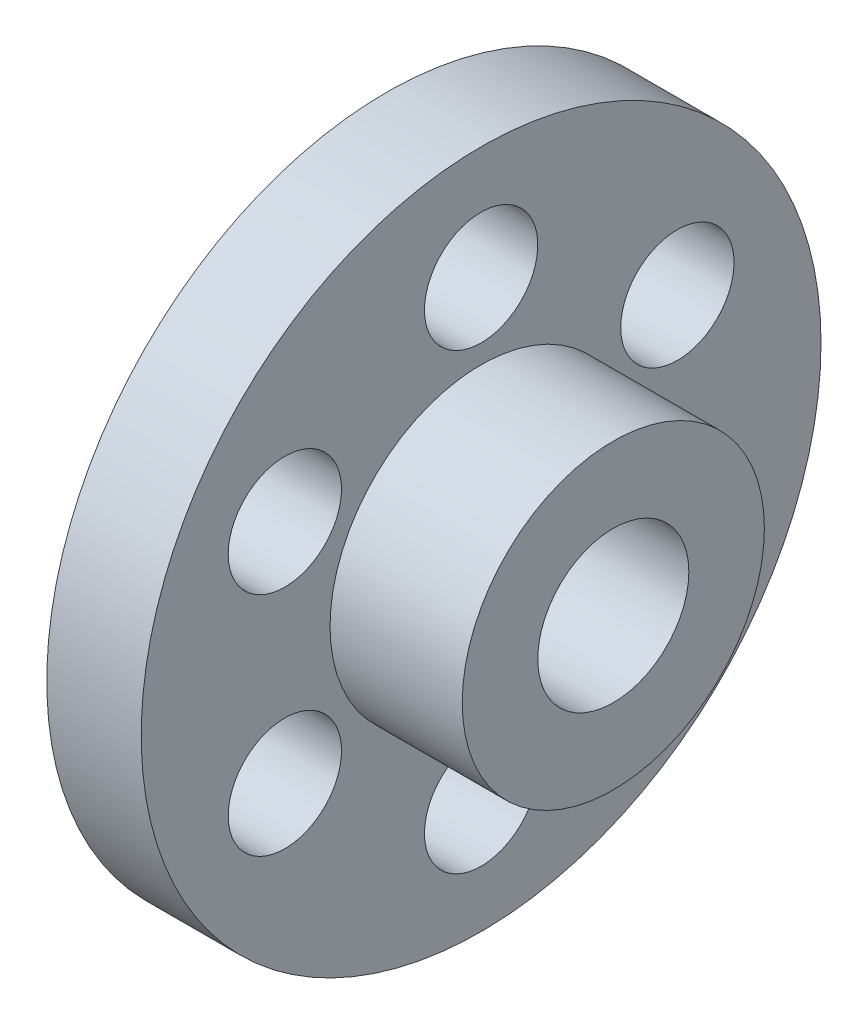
from build123d import *

# Parameters (mm, degrees)
SZKIC2_R                   = 20
WYTNIJ_WYCI_GNI_CIE1_DEPTH = 141.712472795
SZKIC3_R                   = 15
WYTNIJ_WYCI_GNI_CIE2_DEPTH = 141.712472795
SZYK_KO_OWY1_COUNT         = 6


with BuildPart() as part:
    # Szkic1 → Obr_t1 (revolve)
    with BuildSketch(Plane.XY, mode=Mode.PRIVATE) as obr_t1_sk:
        Polygon((0, 0), (0, 90), (25, 90), (25, 40), (60, 40), (60, 0), align=None)
    revolve(obr_t1_sk.sketch.rotate(Axis((0, 0, 0), (-1, 0, 0)), 90), axis=Axis((0, 0, 0), (-1, 0, 0)))

    # Szkic2 → Wytnij-wyci_gni_cie1 (cut, through all)
    with BuildSketch(Plane(origin=(60, 0, 0), x_dir=(0, 0, -1), z_dir=(1, 0, 0))):
        Circle(SZKIC2_R)
    extrude(amount=-WYTNIJ_WYCI_GNI_CIE1_DEPTH, mode=Mode.SUBTRACT)

    # Szkic3 → Wytnij-wyci_gni_cie2 (cut, through all)
    with BuildSketch(Plane.ZY):
        with Locations((0, 60)):
            Circle(SZKIC3_R)
    wytnij_wyci_gni_cie2 = extrude(amount=-WYTNIJ_WYCI_GNI_CIE2_DEPTH, mode=Mode.SUBTRACT)

    # Szyk ko_owy1: Wytnij-wyci_gni_cie2 ×6 about axis
    szyk_ko_owy1_axis = Axis((0, 0, 0), (1, 0, 0))
    for i in range(1, SZYK_KO_OWY1_COUNT):
        add(wytnij_wyci_gni_cie2.rotate(szyk_ko_owy1_axis, i * 360 / SZYK_KO_OWY1_COUNT), mode=Mode.SUBTRACT)


solid = part.part
